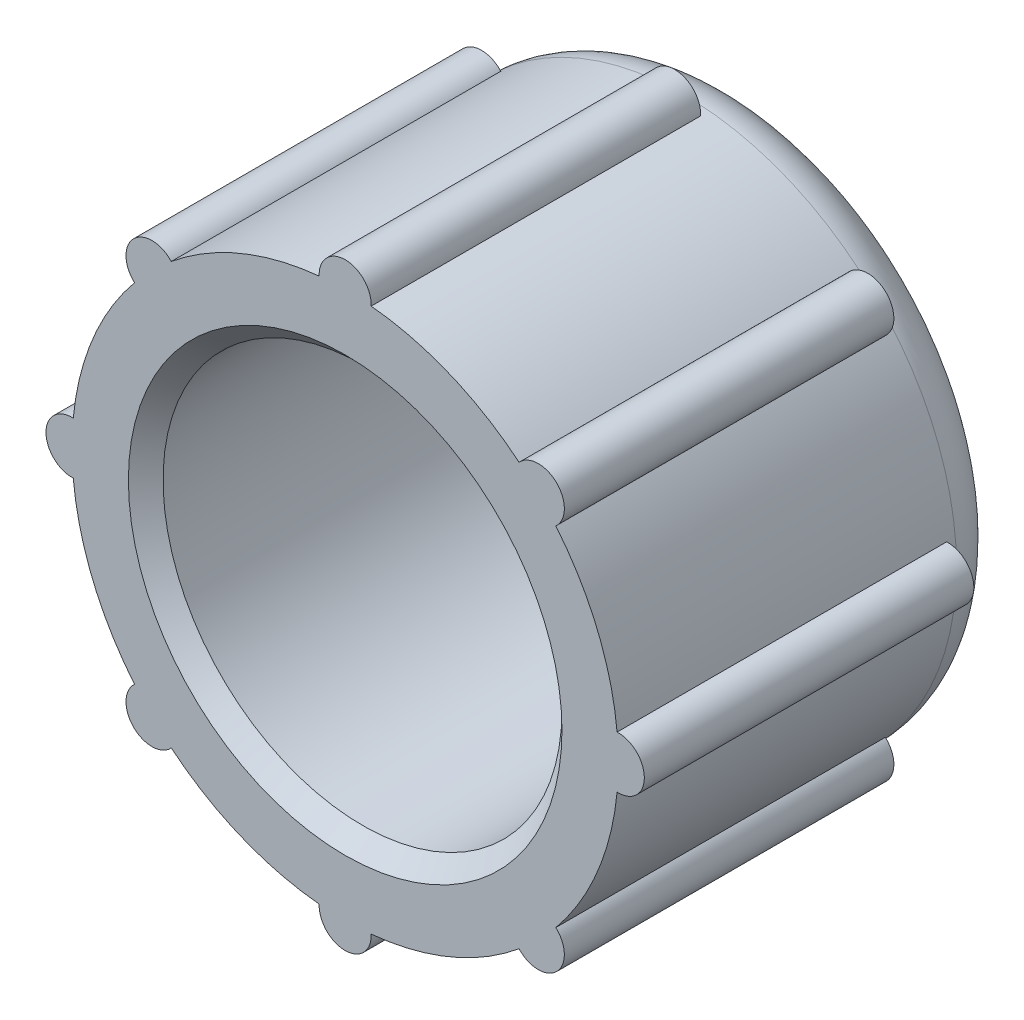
from build123d import *

# Parameters (mm, degrees)
ESQUISSE1_R                  = 15.75
BASE_EXTRUSION_DEPTH         = 22.5
ESQUISSE3_R                  = 1.5
BOSS_EXTRU_1_DEPTH           = 19
R_P_TITION_CIRCULAIRE1_COUNT = 8
ESQUISSE4_R                  = 8.75
ENL_V_MAT_EXTRU_1_DEPTH      = 119
ESQUISSE5_R                  = 11.5
ENL_V_MAT_EXTRU_2_DEPTH      = 19
CHANFREIN4_SIZE              = 1
ESQUISSE6_R                  = 11.5
ENL_V_MAT_EXTRU_3_DEPTH      = 19
CONG_3_R                     = 3


with BuildPart() as part:
    # Esquisse1 → Base-Extrusion (new body)
    with BuildSketch(Plane.XY):
        with Locations(Location((0, 0, 0), (0, 0, 174.541194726))):
            Circle(ESQUISSE1_R)
    extrude(amount=BASE_EXTRUSION_DEPTH)

    # Esquisse3 → Boss.-Extru.1 (add)
    with BuildSketch(Plane.XY.offset(22.5)):
        with Locations((0, 15.75)):
            Circle(ESQUISSE3_R)
    boss_extru_1 = extrude(amount=-BOSS_EXTRU_1_DEPTH)

    # R_p_tition circulaire1: Boss.-Extru.1 ×8 about axis
    r_p_tition_circulaire1_axis = Axis((0, 0, -50), (0, 0, 1))
    for i in range(1, R_P_TITION_CIRCULAIRE1_COUNT):
        add(boss_extru_1.rotate(r_p_tition_circulaire1_axis, i * 360 / R_P_TITION_CIRCULAIRE1_COUNT))

    # Esquisse4 → Enl_v. mat.-Extru.1 (cut)
    with BuildSketch(Plane.XY.offset(22.5)):
        Circle(ESQUISSE4_R)
    extrude(amount=-ENL_V_MAT_EXTRU_1_DEPTH, mode=Mode.SUBTRACT)

    # Esquisse5 → Enl_v. mat.-Extru.2 (cut)
    with BuildSketch(Plane.XY.offset(22.5)):
        Circle(ESQUISSE5_R)
    extrude(amount=-ENL_V_MAT_EXTRU_2_DEPTH, mode=Mode.SUBTRACT)

    # Chanfrein4
    chanfrein4_edges = [part.edges().sort_by_distance(p)[0] for p in [
        (-11.5, 0, 22.5),
    ]]
    chamfer(chanfrein4_edges, length=CHANFREIN4_SIZE)

    # Esquisse6 → Enl_v. mat.-Extru.3 (cut)
    with BuildSketch(Plane.XY.offset(22.5)):
        Circle(ESQUISSE6_R)
    extrude(amount=-ENL_V_MAT_EXTRU_3_DEPTH, mode=Mode.SUBTRACT)

    # Cong_3
    cong_3_edges = [part.edges().sort_by_distance(p)[0] for p in [
        (15.678571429, -1.498298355, 0),
    ]]
    fillet(cong_3_edges, radius=CONG_3_R)


solid = part.part
